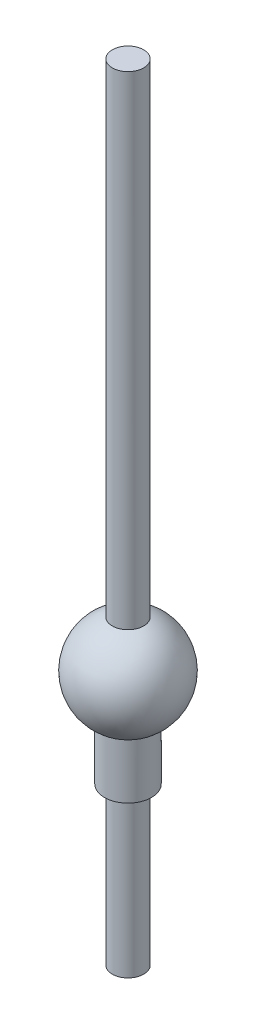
ISO-10303-21;
HEADER;
FILE_DESCRIPTION(('STEP AP214'),'2;1');
FILE_NAME('part.step','',(''),(''),'','','');
FILE_SCHEMA(('AUTOMOTIVE_DESIGN { 1 0 10303 214 1 1 1 1 }'));
ENDSEC;
DATA;
#1=APPLICATION_CONTEXT('core data for automotive mechanical design processes');
#2=APPLICATION_PROTOCOL_DEFINITION('international standard','automotive_design',2000,#1);
#3=PRODUCT_CONTEXT('',#1,'mechanical');
#4=PRODUCT('Part','Part','',(#3));
#5=PRODUCT_RELATED_PRODUCT_CATEGORY('part','',(#4));
#6=PRODUCT_DEFINITION_FORMATION('','',#4);
#7=PRODUCT_DEFINITION_CONTEXT('part definition',#1,'design');
#8=PRODUCT_DEFINITION('design','',#6,#7);
#9=PRODUCT_DEFINITION_SHAPE('','',#8);
#10=(LENGTH_UNIT() NAMED_UNIT(*) SI_UNIT(.MILLI.,.METRE.));
#11=(NAMED_UNIT(*) PLANE_ANGLE_UNIT() SI_UNIT($,.RADIAN.));
#12=(NAMED_UNIT(*) SI_UNIT($,.STERADIAN.) SOLID_ANGLE_UNIT());
#13=UNCERTAINTY_MEASURE_WITH_UNIT(LENGTH_MEASURE(1.E-05),#10,'distance_accuracy_value','');
#14=(GEOMETRIC_REPRESENTATION_CONTEXT(3) GLOBAL_UNCERTAINTY_ASSIGNED_CONTEXT((#13)) GLOBAL_UNIT_ASSIGNED_CONTEXT((#10,
#11,#12)) REPRESENTATION_CONTEXT('',''));
#15=CARTESIAN_POINT('',(0.,0.,0.));
#16=DIRECTION('',(0.,0.,1.));
#17=DIRECTION('',(1.,0.,0.));
#18=AXIS2_PLACEMENT_3D('',#15,#16,#17);
#19=CARTESIAN_POINT('',(0.,0.,0.));
#20=DIRECTION('',(0.,-1.,0.));
#21=DIRECTION('',(0.,0.,-1.));
#22=AXIS2_PLACEMENT_3D('',#19,#20,#21);
#23=PLANE('',#22);
#24=CARTESIAN_POINT('',(0.,0.,0.));
#25=DIRECTION('',(0.,-1.,0.));
#26=DIRECTION('',(0.,0.,-1.));
#27=AXIS2_PLACEMENT_3D('',#24,#25,#26);
#28=CIRCLE('',#27,2.);
#29=CARTESIAN_POINT('',(0.,0.,-2.));
#30=VERTEX_POINT('',#29);
#31=EDGE_CURVE('E10',#30,#30,#28,.T.);
#32=ORIENTED_EDGE('',*,*,#31,.T.);
#33=EDGE_LOOP('',(#32));
#34=FACE_BOUND('',#33,.T.);
#35=ADVANCED_FACE('F30',(#34),#23,.T.);
#36=CARTESIAN_POINT('',(0.,0.,0.));
#37=DIRECTION('',(0.,-1.,0.));
#38=DIRECTION('',(0.,0.,-1.));
#39=AXIS2_PLACEMENT_3D('',#36,#37,#38);
#40=CYLINDRICAL_SURFACE('',#39,2.);
#41=CARTESIAN_POINT('',(0.,20.,0.));
#42=DIRECTION('',(0.,-1.,0.));
#43=DIRECTION('',(0.,0.,-1.));
#44=AXIS2_PLACEMENT_3D('',#41,#42,#43);
#45=CIRCLE('',#44,2.);
#46=CARTESIAN_POINT('',(0.,20.,-2.));
#47=VERTEX_POINT('',#46);
#48=EDGE_CURVE('E36',#47,#47,#45,.T.);
#49=ORIENTED_EDGE('',*,*,#48,.T.);
#50=EDGE_LOOP('',(#49));
#51=FACE_BOUND('',#50,.T.);
#52=ORIENTED_EDGE('',*,*,#31,.F.);
#53=EDGE_LOOP('',(#52));
#54=FACE_BOUND('',#53,.T.);
#55=ADVANCED_FACE('F68',(#51,#54),#40,.T.);
#56=CARTESIAN_POINT('',(2.,20.,0.));
#57=DIRECTION('',(0.,-1.,0.));
#58=DIRECTION('',(0.,0.,-1.));
#59=AXIS2_PLACEMENT_3D('',#56,#57,#58);
#60=PLANE('',#59);
#61=CARTESIAN_POINT('',(0.,20.,0.));
#62=DIRECTION('',(0.,-1.,0.));
#63=DIRECTION('',(0.,0.,-1.));
#64=AXIS2_PLACEMENT_3D('',#61,#62,#63);
#65=CIRCLE('',#64,3.);
#66=CARTESIAN_POINT('',(0.,20.,-3.));
#67=VERTEX_POINT('',#66);
#68=EDGE_CURVE('E40',#67,#67,#65,.T.);
#69=ORIENTED_EDGE('',*,*,#68,.T.);
#70=EDGE_LOOP('',(#69));
#71=FACE_BOUND('',#70,.T.);
#72=ORIENTED_EDGE('',*,*,#48,.F.);
#73=EDGE_LOOP('',(#72));
#74=FACE_BOUND('',#73,.T.);
#75=ADVANCED_FACE('F72',(#71,#74),#60,.T.);
#76=CARTESIAN_POINT('',(0.,0.,0.));
#77=DIRECTION('',(0.,-1.,0.));
#78=DIRECTION('',(0.,0.,-1.));
#79=AXIS2_PLACEMENT_3D('',#76,#77,#78);
#80=CYLINDRICAL_SURFACE('',#79,3.);
#81=CARTESIAN_POINT('',(0.,27.0170719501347,0.));
#82=DIRECTION('',(0.,-1.,0.));
#83=DIRECTION('',(0.,0.,-1.));
#84=AXIS2_PLACEMENT_3D('',#81,#82,#83);
#85=CIRCLE('',#84,3.);
#86=CARTESIAN_POINT('',(3.,27.0170719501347,0.));
#87=VERTEX_POINT('',#86);
#88=EDGE_CURVE('E44',#87,#87,#85,.T.);
#89=ORIENTED_EDGE('',*,*,#88,.T.);
#90=EDGE_LOOP('',(#89));
#91=FACE_BOUND('',#90,.T.);
#92=ORIENTED_EDGE('',*,*,#68,.F.);
#93=EDGE_LOOP('',(#92));
#94=FACE_BOUND('',#93,.T.);
#95=ADVANCED_FACE('F76',(#91,#94),#80,.T.);
#96=CARTESIAN_POINT('',(0.,32.5,0.));
#97=DIRECTION('',(0.,-1.,0.));
#98=DIRECTION('',(1.,0.,0.));
#99=AXIS2_PLACEMENT_3D('',#96,#97,#98);
#100=SPHERICAL_SURFACE('',#99,6.25);
#101=CARTESIAN_POINT('',(0.,38.4213596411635,0.));
#102=DIRECTION('',(0.,-1.,0.));
#103=DIRECTION('',(0.,0.,-1.));
#104=AXIS2_PLACEMENT_3D('',#101,#102,#103);
#105=CIRCLE('',#104,2.);
#106=CARTESIAN_POINT('',(1.99999999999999,38.4213596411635,0.));
#107=VERTEX_POINT('',#106);
#108=EDGE_CURVE('E49',#107,#107,#105,.T.);
#109=CARTESIAN_POINT('',(1.99999999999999,38.4213596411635,0.));
#110=CARTESIAN_POINT('',(2.14280792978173,38.3731355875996,0.));
#111=CARTESIAN_POINT('',(2.28386336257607,38.3197269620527,0.));
#112=CARTESIAN_POINT('',(2.56174863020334,38.2028614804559,0.));
#113=CARTESIAN_POINT('',(2.69857846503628,38.1394046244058,0.));
#114=CARTESIAN_POINT('',(2.96729193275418,38.002763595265,0.));
#115=CARTESIAN_POINT('',(3.09917556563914,37.9295794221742,0.));
#116=CARTESIAN_POINT('',(3.3573078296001,37.7738696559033,0.));
#117=CARTESIAN_POINT('',(3.4835564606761,37.6913440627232,0.));
#118=CARTESIAN_POINT('',(3.72975781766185,37.5173824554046,0.));
#119=CARTESIAN_POINT('',(3.8497105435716,37.4259464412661,0.));
#120=CARTESIAN_POINT('',(4.08269255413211,37.2346426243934,0.));
#121=CARTESIAN_POINT('',(4.19572183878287,37.1347748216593,0.));
#122=CARTESIAN_POINT('',(4.41426554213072,36.9271299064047,0.));
#123=CARTESIAN_POINT('',(4.5197799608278,36.8193527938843,0.));
#124=CARTESIAN_POINT('',(4.72274185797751,36.59645319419,0.));
#125=CARTESIAN_POINT('',(4.82018933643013,36.4813307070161,0.));
#126=CARTESIAN_POINT('',(5.00650747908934,36.2443427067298,0.));
#127=CARTESIAN_POINT('',(5.09537814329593,36.1224771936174,0.));
#128=CARTESIAN_POINT('',(5.26407766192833,35.8726407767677,0.));
#129=CARTESIAN_POINT('',(5.34390651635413,35.7446698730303,0.));
#130=CARTESIAN_POINT('',(5.49410472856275,35.4832922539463,0.));
#131=CARTESIAN_POINT('',(5.56447408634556,35.3498855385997,0.));
#132=CARTESIAN_POINT('',(5.69538511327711,35.0783343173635,0.));
#133=CARTESIAN_POINT('',(5.75592678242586,34.9401898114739,0.));
#134=CARTESIAN_POINT('',(5.86686566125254,34.6598858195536,0.));
#135=CARTESIAN_POINT('',(5.91726287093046,34.5177263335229,0.));
#136=CARTESIAN_POINT('',(6.00764913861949,34.2301361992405,0.));
#137=CARTESIAN_POINT('',(6.0476381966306,34.0847055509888,0.));
#138=CARTESIAN_POINT('',(6.11699892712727,33.7913340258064,0.));
#139=CARTESIAN_POINT('',(6.14637059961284,33.6433931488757,0.));
#140=CARTESIAN_POINT('',(6.19434287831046,33.345775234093,0.));
#141=CARTESIAN_POINT('',(6.21294348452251,33.1960981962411,0.));
#142=CARTESIAN_POINT('',(6.23927630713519,32.8957911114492,0.));
#143=CARTESIAN_POINT('',(6.24700852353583,32.7451610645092,0.));
#144=CARTESIAN_POINT('',(6.251564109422,32.4437360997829,0.));
#145=CARTESIAN_POINT('',(6.24838747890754,32.2929411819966,0.));
#146=CARTESIAN_POINT('',(6.2311419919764,31.9919754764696,0.));
#147=CARTESIAN_POINT('',(6.21707313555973,31.8418046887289,0.));
#148=CARTESIAN_POINT('',(6.17811680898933,31.5428729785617,0.));
#149=CARTESIAN_POINT('',(6.15322933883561,31.3941120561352,0.));
#150=CARTESIAN_POINT('',(6.09276600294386,31.0987784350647,0.));
#151=CARTESIAN_POINT('',(6.05719013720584,30.9522057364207,0.));
#152=CARTESIAN_POINT('',(5.97553615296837,30.6620154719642,0.));
#153=CARTESIAN_POINT('',(5.92945803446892,30.5183979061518,0.));
#154=CARTESIAN_POINT('',(5.82704063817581,30.2348693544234,0.));
#155=CARTESIAN_POINT('',(5.77070136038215,30.0949583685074,0.));
#156=CARTESIAN_POINT('',(5.64805642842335,29.8195750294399,0.));
#157=CARTESIAN_POINT('',(5.58175077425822,29.6841026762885,0.));
#158=CARTESIAN_POINT('',(5.43952001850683,29.4183054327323,0.));
#159=CARTESIAN_POINT('',(5.36359491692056,29.2879805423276,0.));
#160=CARTESIAN_POINT('',(5.20252252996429,29.0331601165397,0.));
#161=CARTESIAN_POINT('',(5.11737524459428,28.9086645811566,0.));
#162=CARTESIAN_POINT('',(4.93830399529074,28.666154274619,0.));
#163=CARTESIAN_POINT('',(4.8443800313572,28.5481395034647,0.));
#164=CARTESIAN_POINT('',(4.64824689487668,28.3192081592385,0.));
#165=CARTESIAN_POINT('',(4.54603772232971,28.2082915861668,0.));
#166=CARTESIAN_POINT('',(4.33386882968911,27.9941371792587,0.));
#167=CARTESIAN_POINT('',(4.22390910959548,27.8908993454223,0.));
#168=CARTESIAN_POINT('',(3.99681493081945,27.6926418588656,0.));
#169=CARTESIAN_POINT('',(3.87968047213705,27.5976222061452,0.));
#170=CARTESIAN_POINT('',(3.63884794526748,27.4163009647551,0.));
#171=CARTESIAN_POINT('',(3.51514987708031,27.3299993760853,0.));
#172=CARTESIAN_POINT('',(3.26184388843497,27.1665556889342,0.));
#173=CARTESIAN_POINT('',(3.1322359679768,27.0894135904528,0.));
#174=CARTESIAN_POINT('',(3.,27.0170719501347,0.));
#175=B_SPLINE_CURVE_WITH_KNOTS('',3,(#109,#110,#111,#112,#113,#114,#115,#116,#117,#118,#119,
#120,#121,#122,#123,#124,#125,#126,#127,#128,#129,#130,#131,#132,#133,#134,#135,#136,#137,#138,
#139,#140,#141,#142,#143,#144,#145,#146,#147,#148,#149,#150,#151,#152,#153,#154,#155,#156,#157,
#158,#159,#160,#161,#162,#163,#164,#165,#166,#167,#168,#169,#170,#171,#172,#173,#174),
.UNSPECIFIED.,.F.,.F.,(4,2,2,2,2,2,2,2,2,2,2,2,2,2,2,2,2,2,2,2,2,2,2,2,2,2,2,2,2,2,2,2,4),(0.,
0.452090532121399,0.904181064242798,1.3562715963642,1.80836212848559,2.26045266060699,
2.71254319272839,3.16463372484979,3.61672425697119,4.06881478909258,4.52090532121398,
4.97299585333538,5.42508638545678,5.87717691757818,6.32926744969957,6.78135798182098,
7.23344851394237,7.68553904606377,8.13762957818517,8.58972011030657,9.04181064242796,
9.49390117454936,9.94599170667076,10.3980822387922,10.8501727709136,11.302263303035,
11.7543538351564,12.2064443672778,12.6585348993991,13.1106254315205,13.5627159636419,
14.0148064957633,14.4668970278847),.UNSPECIFIED.);
#176=EDGE_CURVE('BSEAM65',#107,#87,#175,.T.);
#177=ORIENTED_EDGE('',*,*,#108,.T.);
#178=ORIENTED_EDGE('',*,*,#88,.F.);
#179=ORIENTED_EDGE('',*,*,#176,.T.);
#180=ORIENTED_EDGE('',*,*,#176,.F.);
#181=EDGE_LOOP('',(#177,#179,#178,#180));
#182=FACE_BOUND('',#181,.T.);
#183=ADVANCED_FACE('F65',(#182),#100,.T.);
#184=CARTESIAN_POINT('',(0.,0.,0.));
#185=DIRECTION('',(0.,-1.,0.));
#186=DIRECTION('',(0.,0.,-1.));
#187=AXIS2_PLACEMENT_3D('',#184,#185,#186);
#188=CYLINDRICAL_SURFACE('',#187,2.);
#189=CARTESIAN_POINT('',(0.,100.,0.));
#190=DIRECTION('',(0.,-1.,0.));
#191=DIRECTION('',(0.,0.,-1.));
#192=AXIS2_PLACEMENT_3D('',#189,#190,#191);
#193=CIRCLE('',#192,2.);
#194=CARTESIAN_POINT('',(0.,100.,-2.));
#195=VERTEX_POINT('',#194);
#196=EDGE_CURVE('E52',#195,#195,#193,.T.);
#197=ORIENTED_EDGE('',*,*,#196,.T.);
#198=EDGE_LOOP('',(#197));
#199=FACE_BOUND('',#198,.T.);
#200=ORIENTED_EDGE('',*,*,#108,.F.);
#201=EDGE_LOOP('',(#200));
#202=FACE_BOUND('',#201,.T.);
#203=ADVANCED_FACE('F56',(#199,#202),#188,.T.);
#204=CARTESIAN_POINT('',(2.,100.,0.));
#205=DIRECTION('',(0.,1.,0.));
#206=DIRECTION('',(0.,0.,1.));
#207=AXIS2_PLACEMENT_3D('',#204,#205,#206);
#208=PLANE('',#207);
#209=ORIENTED_EDGE('',*,*,#196,.F.);
#210=EDGE_LOOP('',(#209));
#211=FACE_BOUND('',#210,.T.);
#212=ADVANCED_FACE('F59',(#211),#208,.T.);
#213=CLOSED_SHELL('',(#35,#55,#75,#95,#183,#203,#212));
#214=MANIFOLD_SOLID_BREP('B2',#213);
#215=ADVANCED_BREP_SHAPE_REPRESENTATION('',(#18,#214),#14);
#216=SHAPE_DEFINITION_REPRESENTATION(#9,#215);
ENDSEC;
END-ISO-10303-21;
